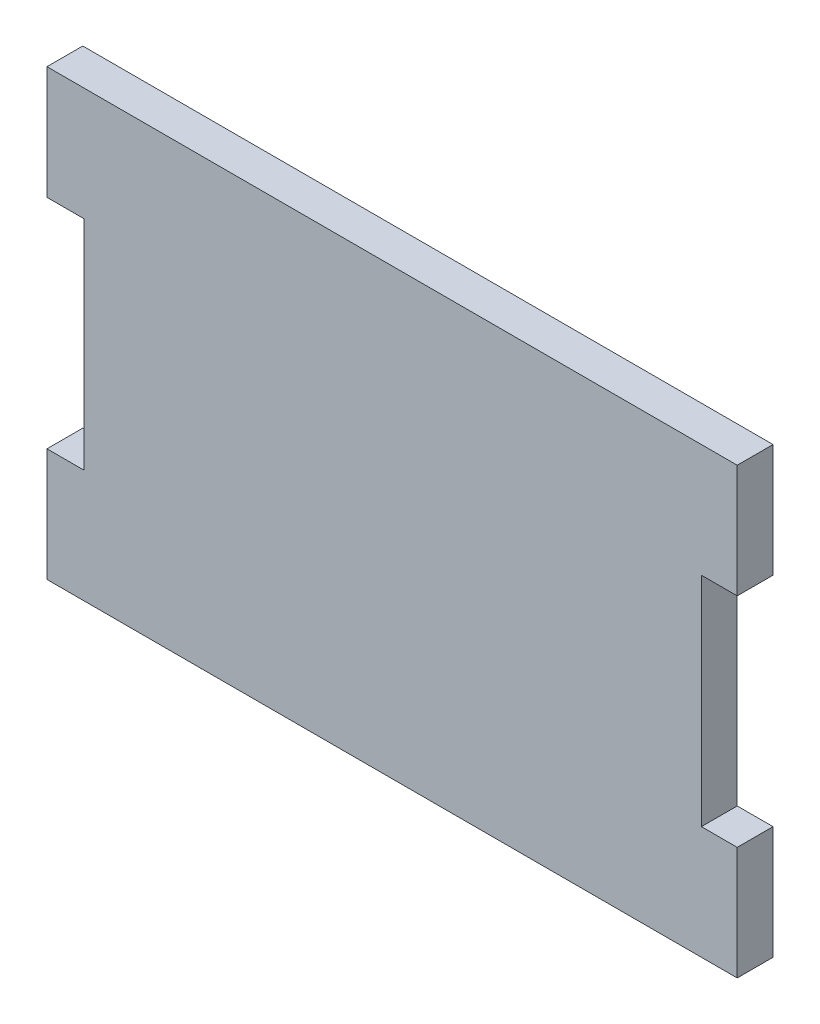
ISO-10303-21;
HEADER;
FILE_DESCRIPTION(('STEP AP214'),'2;1');
FILE_NAME('part.step','',(''),(''),'','','');
FILE_SCHEMA(('AUTOMOTIVE_DESIGN { 1 0 10303 214 1 1 1 1 }'));
ENDSEC;
DATA;
#1=APPLICATION_CONTEXT('core data for automotive mechanical design processes');
#2=APPLICATION_PROTOCOL_DEFINITION('international standard','automotive_design',2000,#1);
#3=PRODUCT_CONTEXT('',#1,'mechanical');
#4=PRODUCT('Part','Part','',(#3));
#5=PRODUCT_RELATED_PRODUCT_CATEGORY('part','',(#4));
#6=PRODUCT_DEFINITION_FORMATION('','',#4);
#7=PRODUCT_DEFINITION_CONTEXT('part definition',#1,'design');
#8=PRODUCT_DEFINITION('design','',#6,#7);
#9=PRODUCT_DEFINITION_SHAPE('','',#8);
#10=(LENGTH_UNIT() NAMED_UNIT(*) SI_UNIT(.MILLI.,.METRE.));
#11=(NAMED_UNIT(*) PLANE_ANGLE_UNIT() SI_UNIT($,.RADIAN.));
#12=(NAMED_UNIT(*) SI_UNIT($,.STERADIAN.) SOLID_ANGLE_UNIT());
#13=UNCERTAINTY_MEASURE_WITH_UNIT(LENGTH_MEASURE(1.E-05),#10,'distance_accuracy_value','');
#14=(GEOMETRIC_REPRESENTATION_CONTEXT(3) GLOBAL_UNCERTAINTY_ASSIGNED_CONTEXT((#13)) GLOBAL_UNIT_ASSIGNED_CONTEXT((#10,
#11,#12)) REPRESENTATION_CONTEXT('',''));
#15=CARTESIAN_POINT('',(0.,0.,0.));
#16=DIRECTION('',(0.,0.,1.));
#17=DIRECTION('',(1.,0.,0.));
#18=AXIS2_PLACEMENT_3D('',#15,#16,#17);
#19=CARTESIAN_POINT('',(45.683259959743,0.,2.5));
#20=DIRECTION('',(1.,0.,0.));
#21=DIRECTION('',(0.,0.,-1.));
#22=AXIS2_PLACEMENT_3D('',#19,#20,#21);
#23=PLANE('',#22);
#24=DIRECTION('',(0.,-1.,0.));
#25=VECTOR('',#24,1.);
#26=CARTESIAN_POINT('',(45.683259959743,0.,0.));
#27=LINE('',#26,#25);
#28=CARTESIAN_POINT('',(45.683259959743,7.6,0.));
#29=VERTEX_POINT('',#28);
#30=CARTESIAN_POINT('',(45.683259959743,-7.6,0.));
#31=VERTEX_POINT('',#30);
#32=EDGE_CURVE('E156',#29,#31,#27,.T.);
#33=ORIENTED_EDGE('',*,*,#32,.F.);
#34=DIRECTION('',(0.,0.,-1.));
#35=VECTOR('',#34,1.);
#36=CARTESIAN_POINT('',(45.683259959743,7.6,2.5));
#37=LINE('',#36,#35);
#38=CARTESIAN_POINT('',(45.683259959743,7.6,2.5));
#39=VERTEX_POINT('',#38);
#40=EDGE_CURVE('E11',#39,#29,#37,.T.);
#41=ORIENTED_EDGE('',*,*,#40,.F.);
#42=DIRECTION('',(0.,-1.,0.));
#43=VECTOR('',#42,1.);
#44=CARTESIAN_POINT('',(45.683259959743,0.,2.5));
#45=LINE('',#44,#43);
#46=CARTESIAN_POINT('',(45.683259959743,-7.6,2.5));
#47=VERTEX_POINT('',#46);
#48=EDGE_CURVE('E187',#39,#47,#45,.T.);
#49=ORIENTED_EDGE('',*,*,#48,.T.);
#50=DIRECTION('',(0.,0.,-1.));
#51=VECTOR('',#50,1.);
#52=CARTESIAN_POINT('',(45.683259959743,-7.6,2.5));
#53=LINE('',#52,#51);
#54=EDGE_CURVE('E100',#47,#31,#53,.T.);
#55=ORIENTED_EDGE('',*,*,#54,.T.);
#56=EDGE_LOOP('',(#33,#41,#49,#55));
#57=FACE_BOUND('',#56,.T.);
#58=ADVANCED_FACE('F38',(#57),#23,.T.);
#59=CARTESIAN_POINT('',(0.,7.59999999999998,2.5));
#60=DIRECTION('',(0.,-1.,0.));
#61=DIRECTION('',(1.,0.,0.));
#62=AXIS2_PLACEMENT_3D('',#59,#60,#61);
#63=PLANE('',#62);
#64=DIRECTION('',(-1.,0.,0.));
#65=VECTOR('',#64,1.);
#66=CARTESIAN_POINT('',(0.,7.59999999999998,0.));
#67=LINE('',#66,#65);
#68=CARTESIAN_POINT('',(48.183259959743,7.6,0.));
#69=VERTEX_POINT('',#68);
#70=EDGE_CURVE('E159',#69,#29,#67,.T.);
#71=ORIENTED_EDGE('',*,*,#70,.F.);
#72=DIRECTION('',(0.,0.,-1.));
#73=VECTOR('',#72,1.);
#74=CARTESIAN_POINT('',(48.183259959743,7.6,2.5));
#75=LINE('',#74,#73);
#76=CARTESIAN_POINT('',(48.183259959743,7.6,2.5));
#77=VERTEX_POINT('',#76);
#78=EDGE_CURVE('E46',#77,#69,#75,.T.);
#79=ORIENTED_EDGE('',*,*,#78,.F.);
#80=DIRECTION('',(-1.,0.,0.));
#81=VECTOR('',#80,1.);
#82=CARTESIAN_POINT('',(0.,7.59999999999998,2.5));
#83=LINE('',#82,#81);
#84=EDGE_CURVE('E223',#77,#39,#83,.T.);
#85=ORIENTED_EDGE('',*,*,#84,.T.);
#86=ORIENTED_EDGE('',*,*,#40,.T.);
#87=EDGE_LOOP('',(#71,#79,#85,#86));
#88=FACE_BOUND('',#87,.T.);
#89=ADVANCED_FACE('F212',(#88),#63,.T.);
#90=CARTESIAN_POINT('',(48.183259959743,0.,2.5));
#91=DIRECTION('',(1.,0.,0.));
#92=DIRECTION('',(0.,0.,-1.));
#93=AXIS2_PLACEMENT_3D('',#90,#91,#92);
#94=PLANE('',#93);
#95=DIRECTION('',(0.,-1.,0.));
#96=VECTOR('',#95,1.);
#97=CARTESIAN_POINT('',(48.183259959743,0.,0.));
#98=LINE('',#97,#96);
#99=CARTESIAN_POINT('',(48.183259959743,15.5,0.));
#100=VERTEX_POINT('',#99);
#101=EDGE_CURVE('E162',#100,#69,#98,.T.);
#102=ORIENTED_EDGE('',*,*,#101,.F.);
#103=DIRECTION('',(0.,0.,-1.));
#104=VECTOR('',#103,1.);
#105=CARTESIAN_POINT('',(48.183259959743,15.5,2.5));
#106=LINE('',#105,#104);
#107=CARTESIAN_POINT('',(48.183259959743,15.5,2.5));
#108=VERTEX_POINT('',#107);
#109=EDGE_CURVE('E201',#108,#100,#106,.T.);
#110=ORIENTED_EDGE('',*,*,#109,.F.);
#111=DIRECTION('',(0.,-1.,0.));
#112=VECTOR('',#111,1.);
#113=CARTESIAN_POINT('',(48.183259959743,0.,2.5));
#114=LINE('',#113,#112);
#115=EDGE_CURVE('E208',#108,#77,#114,.T.);
#116=ORIENTED_EDGE('',*,*,#115,.T.);
#117=ORIENTED_EDGE('',*,*,#78,.T.);
#118=EDGE_LOOP('',(#102,#110,#116,#117));
#119=FACE_BOUND('',#118,.T.);
#120=ADVANCED_FACE('F206',(#119),#94,.T.);
#121=CARTESIAN_POINT('',(0.,15.5,2.5));
#122=DIRECTION('',(0.,1.,0.));
#123=DIRECTION('',(0.,0.,1.));
#124=AXIS2_PLACEMENT_3D('',#121,#122,#123);
#125=PLANE('',#124);
#126=DIRECTION('',(1.,0.,0.));
#127=VECTOR('',#126,1.);
#128=CARTESIAN_POINT('',(0.,15.5,0.));
#129=LINE('',#128,#127);
#130=CARTESIAN_POINT('',(0.,15.5,0.));
#131=VERTEX_POINT('',#130);
#132=EDGE_CURVE('E165',#131,#100,#129,.T.);
#133=ORIENTED_EDGE('',*,*,#132,.F.);
#134=DIRECTION('',(0.,0.,-1.));
#135=VECTOR('',#134,1.);
#136=CARTESIAN_POINT('',(0.,15.5,2.5));
#137=LINE('',#136,#135);
#138=CARTESIAN_POINT('',(0.,15.5,2.5));
#139=VERTEX_POINT('',#138);
#140=EDGE_CURVE('E199',#139,#131,#137,.T.);
#141=ORIENTED_EDGE('',*,*,#140,.F.);
#142=DIRECTION('',(1.,0.,0.));
#143=VECTOR('',#142,1.);
#144=CARTESIAN_POINT('',(0.,15.5,2.5));
#145=LINE('',#144,#143);
#146=EDGE_CURVE('E222',#139,#108,#145,.T.);
#147=ORIENTED_EDGE('',*,*,#146,.T.);
#148=ORIENTED_EDGE('',*,*,#109,.T.);
#149=EDGE_LOOP('',(#133,#141,#147,#148));
#150=FACE_BOUND('',#149,.T.);
#151=ADVANCED_FACE('F218',(#150),#125,.T.);
#152=CARTESIAN_POINT('',(0.,0.,2.5));
#153=DIRECTION('',(1.,0.,0.));
#154=DIRECTION('',(0.,1.,0.));
#155=AXIS2_PLACEMENT_3D('',#152,#153,#154);
#156=PLANE('',#155);
#157=DIRECTION('',(0.,-1.,0.));
#158=VECTOR('',#157,1.);
#159=CARTESIAN_POINT('',(0.,0.,0.));
#160=LINE('',#159,#158);
#161=CARTESIAN_POINT('',(0.,7.6,0.));
#162=VERTEX_POINT('',#161);
#163=EDGE_CURVE('E168',#131,#162,#160,.T.);
#164=ORIENTED_EDGE('',*,*,#163,.T.);
#165=DIRECTION('',(0.,0.,-1.));
#166=VECTOR('',#165,1.);
#167=CARTESIAN_POINT('',(0.,7.6,2.5));
#168=LINE('',#167,#166);
#169=CARTESIAN_POINT('',(0.,7.6,2.5));
#170=VERTEX_POINT('',#169);
#171=EDGE_CURVE('E197',#170,#162,#168,.T.);
#172=ORIENTED_EDGE('',*,*,#171,.F.);
#173=DIRECTION('',(0.,-1.,0.));
#174=VECTOR('',#173,1.);
#175=CARTESIAN_POINT('',(0.,0.,2.5));
#176=LINE('',#175,#174);
#177=EDGE_CURVE('E225',#139,#170,#176,.T.);
#178=ORIENTED_EDGE('',*,*,#177,.F.);
#179=ORIENTED_EDGE('',*,*,#140,.T.);
#180=EDGE_LOOP('',(#164,#172,#178,#179));
#181=FACE_BOUND('',#180,.T.);
#182=ADVANCED_FACE('F331',(#181),#156,.F.);
#183=CARTESIAN_POINT('',(0.,7.6,2.5));
#184=DIRECTION('',(0.,-1.,0.));
#185=DIRECTION('',(0.,0.,-1.));
#186=AXIS2_PLACEMENT_3D('',#183,#184,#185);
#187=PLANE('',#186);
#188=DIRECTION('',(-1.,0.,0.));
#189=VECTOR('',#188,1.);
#190=CARTESIAN_POINT('',(0.,7.6,0.));
#191=LINE('',#190,#189);
#192=CARTESIAN_POINT('',(2.59999999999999,7.6,0.));
#193=VERTEX_POINT('',#192);
#194=EDGE_CURVE('E171',#193,#162,#191,.T.);
#195=ORIENTED_EDGE('',*,*,#194,.F.);
#196=DIRECTION('',(0.,0.,-1.));
#197=VECTOR('',#196,1.);
#198=CARTESIAN_POINT('',(2.59999999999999,7.6,2.5));
#199=LINE('',#198,#197);
#200=CARTESIAN_POINT('',(2.59999999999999,7.6,2.5));
#201=VERTEX_POINT('',#200);
#202=EDGE_CURVE('E195',#201,#193,#199,.T.);
#203=ORIENTED_EDGE('',*,*,#202,.F.);
#204=DIRECTION('',(-1.,0.,0.));
#205=VECTOR('',#204,1.);
#206=CARTESIAN_POINT('',(0.,7.6,2.5));
#207=LINE('',#206,#205);
#208=EDGE_CURVE('E231',#201,#170,#207,.T.);
#209=ORIENTED_EDGE('',*,*,#208,.T.);
#210=ORIENTED_EDGE('',*,*,#171,.T.);
#211=EDGE_LOOP('',(#195,#203,#209,#210));
#212=FACE_BOUND('',#211,.T.);
#213=ADVANCED_FACE('F321',(#212),#187,.T.);
#214=CARTESIAN_POINT('',(2.59999999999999,0.,2.5));
#215=DIRECTION('',(-1.,0.,0.));
#216=DIRECTION('',(0.,0.,1.));
#217=AXIS2_PLACEMENT_3D('',#214,#215,#216);
#218=PLANE('',#217);
#219=DIRECTION('',(0.,1.,0.));
#220=VECTOR('',#219,1.);
#221=CARTESIAN_POINT('',(2.59999999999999,0.,0.));
#222=LINE('',#221,#220);
#223=CARTESIAN_POINT('',(2.59999999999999,-7.6,0.));
#224=VERTEX_POINT('',#223);
#225=EDGE_CURVE('E174',#224,#193,#222,.T.);
#226=ORIENTED_EDGE('',*,*,#225,.F.);
#227=DIRECTION('',(0.,0.,-1.));
#228=VECTOR('',#227,1.);
#229=CARTESIAN_POINT('',(2.59999999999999,-7.6,2.5));
#230=LINE('',#229,#228);
#231=CARTESIAN_POINT('',(2.59999999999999,-7.6,2.5));
#232=VERTEX_POINT('',#231);
#233=EDGE_CURVE('E193',#232,#224,#230,.T.);
#234=ORIENTED_EDGE('',*,*,#233,.F.);
#235=DIRECTION('',(0.,1.,0.));
#236=VECTOR('',#235,1.);
#237=CARTESIAN_POINT('',(2.59999999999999,0.,2.5));
#238=LINE('',#237,#236);
#239=EDGE_CURVE('E234',#232,#201,#238,.T.);
#240=ORIENTED_EDGE('',*,*,#239,.T.);
#241=ORIENTED_EDGE('',*,*,#202,.T.);
#242=EDGE_LOOP('',(#226,#234,#240,#241));
#243=FACE_BOUND('',#242,.T.);
#244=ADVANCED_FACE('F246',(#243),#218,.T.);
#245=CARTESIAN_POINT('',(0.,-7.6,2.5));
#246=DIRECTION('',(0.,1.,0.));
#247=DIRECTION('',(-1.,0.,0.));
#248=AXIS2_PLACEMENT_3D('',#245,#246,#247);
#249=PLANE('',#248);
#250=DIRECTION('',(1.,0.,0.));
#251=VECTOR('',#250,1.);
#252=CARTESIAN_POINT('',(0.,-7.6,0.));
#253=LINE('',#252,#251);
#254=CARTESIAN_POINT('',(0.,-7.6,0.));
#255=VERTEX_POINT('',#254);
#256=EDGE_CURVE('E177',#255,#224,#253,.T.);
#257=ORIENTED_EDGE('',*,*,#256,.F.);
#258=DIRECTION('',(0.,0.,-1.));
#259=VECTOR('',#258,1.);
#260=CARTESIAN_POINT('',(0.,-7.6,2.5));
#261=LINE('',#260,#259);
#262=CARTESIAN_POINT('',(0.,-7.6,2.5));
#263=VERTEX_POINT('',#262);
#264=EDGE_CURVE('E191',#263,#255,#261,.T.);
#265=ORIENTED_EDGE('',*,*,#264,.F.);
#266=DIRECTION('',(1.,0.,0.));
#267=VECTOR('',#266,1.);
#268=CARTESIAN_POINT('',(0.,-7.6,2.5));
#269=LINE('',#268,#267);
#270=EDGE_CURVE('E237',#263,#232,#269,.T.);
#271=ORIENTED_EDGE('',*,*,#270,.T.);
#272=ORIENTED_EDGE('',*,*,#233,.T.);
#273=EDGE_LOOP('',(#257,#265,#271,#272));
#274=FACE_BOUND('',#273,.T.);
#275=ADVANCED_FACE('F241',(#274),#249,.T.);
#276=CARTESIAN_POINT('',(0.,0.,2.5));
#277=DIRECTION('',(1.,0.,0.));
#278=DIRECTION('',(0.,1.,0.));
#279=AXIS2_PLACEMENT_3D('',#276,#277,#278);
#280=PLANE('',#279);
#281=DIRECTION('',(0.,-1.,0.));
#282=VECTOR('',#281,1.);
#283=CARTESIAN_POINT('',(0.,0.,0.));
#284=LINE('',#283,#282);
#285=CARTESIAN_POINT('',(0.,-15.5,0.));
#286=VERTEX_POINT('',#285);
#287=EDGE_CURVE('E180',#255,#286,#284,.T.);
#288=ORIENTED_EDGE('',*,*,#287,.T.);
#289=DIRECTION('',(0.,0.,-1.));
#290=VECTOR('',#289,1.);
#291=CARTESIAN_POINT('',(0.,-15.5,2.5));
#292=LINE('',#291,#290);
#293=CARTESIAN_POINT('',(0.,-15.5,2.5));
#294=VERTEX_POINT('',#293);
#295=EDGE_CURVE('E149',#294,#286,#292,.T.);
#296=ORIENTED_EDGE('',*,*,#295,.F.);
#297=DIRECTION('',(0.,-1.,0.));
#298=VECTOR('',#297,1.);
#299=CARTESIAN_POINT('',(0.,0.,2.5));
#300=LINE('',#299,#298);
#301=EDGE_CURVE('E136',#263,#294,#300,.T.);
#302=ORIENTED_EDGE('',*,*,#301,.F.);
#303=ORIENTED_EDGE('',*,*,#264,.T.);
#304=EDGE_LOOP('',(#288,#296,#302,#303));
#305=FACE_BOUND('',#304,.T.);
#306=ADVANCED_FACE('F250',(#305),#280,.F.);
#307=CARTESIAN_POINT('',(0.,-15.5,2.5));
#308=DIRECTION('',(0.,1.,0.));
#309=DIRECTION('',(0.,0.,1.));
#310=AXIS2_PLACEMENT_3D('',#307,#308,#309);
#311=PLANE('',#310);
#312=DIRECTION('',(1.,0.,0.));
#313=VECTOR('',#312,1.);
#314=CARTESIAN_POINT('',(0.,-15.5,0.));
#315=LINE('',#314,#313);
#316=CARTESIAN_POINT('',(48.183259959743,-15.5,0.));
#317=VERTEX_POINT('',#316);
#318=EDGE_CURVE('E145',#286,#317,#315,.T.);
#319=ORIENTED_EDGE('',*,*,#318,.T.);
#320=DIRECTION('',(0.,0.,-1.));
#321=VECTOR('',#320,1.);
#322=CARTESIAN_POINT('',(48.183259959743,-15.5,2.5));
#323=LINE('',#322,#321);
#324=CARTESIAN_POINT('',(48.183259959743,-15.5,2.5));
#325=VERTEX_POINT('',#324);
#326=EDGE_CURVE('E142',#325,#317,#323,.T.);
#327=ORIENTED_EDGE('',*,*,#326,.F.);
#328=DIRECTION('',(1.,0.,0.));
#329=VECTOR('',#328,1.);
#330=CARTESIAN_POINT('',(0.,-15.5,2.5));
#331=LINE('',#330,#329);
#332=EDGE_CURVE('E129',#294,#325,#331,.T.);
#333=ORIENTED_EDGE('',*,*,#332,.F.);
#334=ORIENTED_EDGE('',*,*,#295,.T.);
#335=EDGE_LOOP('',(#319,#327,#333,#334));
#336=FACE_BOUND('',#335,.T.);
#337=ADVANCED_FACE('F143',(#336),#311,.F.);
#338=CARTESIAN_POINT('',(48.183259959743,0.,2.5));
#339=DIRECTION('',(1.,0.,0.));
#340=DIRECTION('',(0.,0.,-1.));
#341=AXIS2_PLACEMENT_3D('',#338,#339,#340);
#342=PLANE('',#341);
#343=DIRECTION('',(0.,-1.,0.));
#344=VECTOR('',#343,1.);
#345=CARTESIAN_POINT('',(48.183259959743,0.,0.));
#346=LINE('',#345,#344);
#347=CARTESIAN_POINT('',(48.183259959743,-7.6,0.));
#348=VERTEX_POINT('',#347);
#349=EDGE_CURVE('E183',#348,#317,#346,.T.);
#350=ORIENTED_EDGE('',*,*,#349,.F.);
#351=DIRECTION('',(0.,0.,-1.));
#352=VECTOR('',#351,1.);
#353=CARTESIAN_POINT('',(48.183259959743,-7.6,2.5));
#354=LINE('',#353,#352);
#355=CARTESIAN_POINT('',(48.183259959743,-7.6,2.5));
#356=VERTEX_POINT('',#355);
#357=EDGE_CURVE('E93',#356,#348,#354,.T.);
#358=ORIENTED_EDGE('',*,*,#357,.F.);
#359=DIRECTION('',(0.,-1.,0.));
#360=VECTOR('',#359,1.);
#361=CARTESIAN_POINT('',(48.183259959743,0.,2.5));
#362=LINE('',#361,#360);
#363=EDGE_CURVE('E133',#356,#325,#362,.T.);
#364=ORIENTED_EDGE('',*,*,#363,.T.);
#365=ORIENTED_EDGE('',*,*,#326,.T.);
#366=EDGE_LOOP('',(#350,#358,#364,#365));
#367=FACE_BOUND('',#366,.T.);
#368=ADVANCED_FACE('F151',(#367),#342,.T.);
#369=CARTESIAN_POINT('',(0.,-7.60000000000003,2.5));
#370=DIRECTION('',(0.,-1.,0.));
#371=DIRECTION('',(1.,0.,0.));
#372=AXIS2_PLACEMENT_3D('',#369,#370,#371);
#373=PLANE('',#372);
#374=DIRECTION('',(-1.,0.,0.));
#375=VECTOR('',#374,1.);
#376=CARTESIAN_POINT('',(0.,-7.60000000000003,0.));
#377=LINE('',#376,#375);
#378=EDGE_CURVE('E185',#348,#31,#377,.T.);
#379=ORIENTED_EDGE('',*,*,#378,.T.);
#380=ORIENTED_EDGE('',*,*,#54,.F.);
#381=DIRECTION('',(-1.,0.,0.));
#382=VECTOR('',#381,1.);
#383=CARTESIAN_POINT('',(0.,-7.60000000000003,2.5));
#384=LINE('',#383,#382);
#385=EDGE_CURVE('E54',#356,#47,#384,.T.);
#386=ORIENTED_EDGE('',*,*,#385,.F.);
#387=ORIENTED_EDGE('',*,*,#357,.T.);
#388=EDGE_LOOP('',(#379,#380,#386,#387));
#389=FACE_BOUND('',#388,.T.);
#390=ADVANCED_FACE('F263',(#389),#373,.F.);
#391=CARTESIAN_POINT('',(0.,0.,2.5));
#392=DIRECTION('',(0.,0.,1.));
#393=DIRECTION('',(1.,0.,0.));
#394=AXIS2_PLACEMENT_3D('',#391,#392,#393);
#395=PLANE('',#394);
#396=ORIENTED_EDGE('',*,*,#48,.F.);
#397=ORIENTED_EDGE('',*,*,#84,.F.);
#398=ORIENTED_EDGE('',*,*,#115,.F.);
#399=ORIENTED_EDGE('',*,*,#146,.F.);
#400=ORIENTED_EDGE('',*,*,#177,.T.);
#401=ORIENTED_EDGE('',*,*,#208,.F.);
#402=ORIENTED_EDGE('',*,*,#239,.F.);
#403=ORIENTED_EDGE('',*,*,#270,.F.);
#404=ORIENTED_EDGE('',*,*,#301,.T.);
#405=ORIENTED_EDGE('',*,*,#332,.T.);
#406=ORIENTED_EDGE('',*,*,#363,.F.);
#407=ORIENTED_EDGE('',*,*,#385,.T.);
#408=EDGE_LOOP('',(#396,#397,#398,#399,#400,#401,#402,#403,#404,#405,#406,#407));
#409=FACE_BOUND('',#408,.T.);
#410=ADVANCED_FACE('F131',(#409),#395,.T.);
#411=CARTESIAN_POINT('',(0.,0.,0.));
#412=DIRECTION('',(0.,0.,1.));
#413=DIRECTION('',(1.,0.,0.));
#414=AXIS2_PLACEMENT_3D('',#411,#412,#413);
#415=PLANE('',#414);
#416=ORIENTED_EDGE('',*,*,#32,.T.);
#417=ORIENTED_EDGE('',*,*,#378,.F.);
#418=ORIENTED_EDGE('',*,*,#349,.T.);
#419=ORIENTED_EDGE('',*,*,#318,.F.);
#420=ORIENTED_EDGE('',*,*,#287,.F.);
#421=ORIENTED_EDGE('',*,*,#256,.T.);
#422=ORIENTED_EDGE('',*,*,#225,.T.);
#423=ORIENTED_EDGE('',*,*,#194,.T.);
#424=ORIENTED_EDGE('',*,*,#163,.F.);
#425=ORIENTED_EDGE('',*,*,#132,.T.);
#426=ORIENTED_EDGE('',*,*,#101,.T.);
#427=ORIENTED_EDGE('',*,*,#70,.T.);
#428=EDGE_LOOP('',(#416,#417,#418,#419,#420,#421,#422,#423,#424,#425,#426,#427));
#429=FACE_BOUND('',#428,.T.);
#430=ADVANCED_FACE('F214',(#429),#415,.F.);
#431=CLOSED_SHELL('',(#58,#89,#120,#151,#182,#213,#244,#275,#306,#337,#368,#390,#410,#430));
#432=MANIFOLD_SOLID_BREP('B2',#431);
#433=ADVANCED_BREP_SHAPE_REPRESENTATION('',(#18,#432),#14);
#434=SHAPE_DEFINITION_REPRESENTATION(#9,#433);
ENDSEC;
END-ISO-10303-21;
